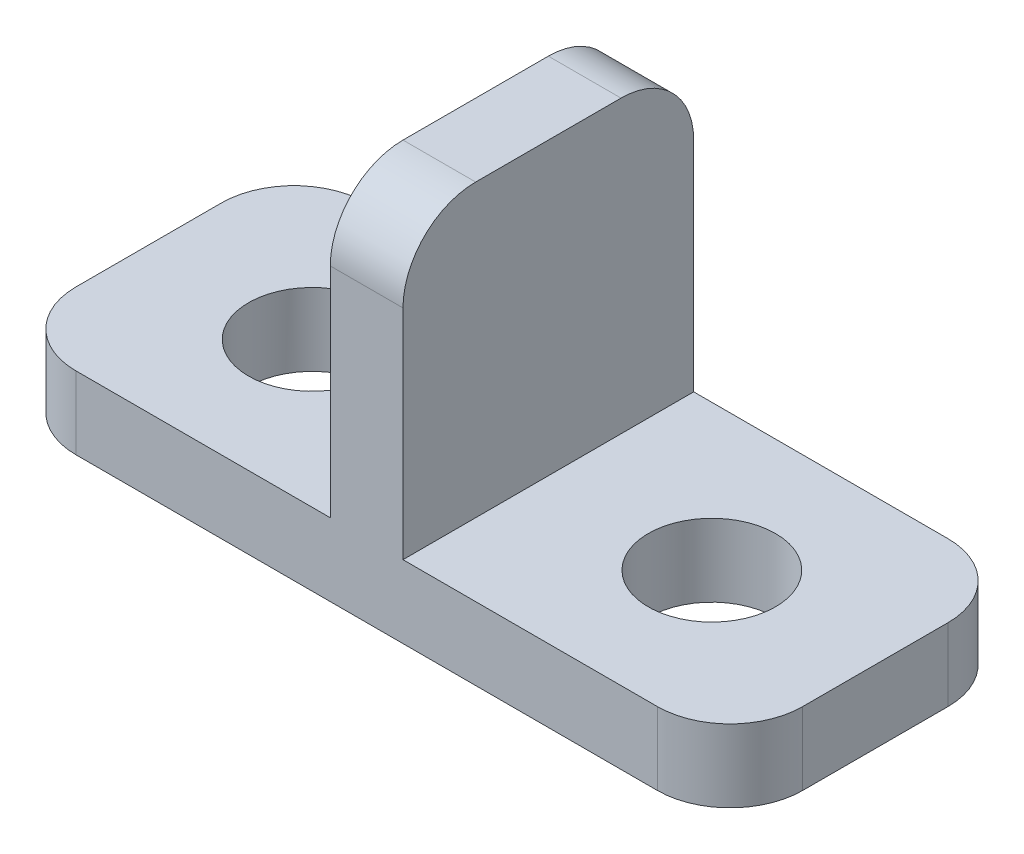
ISO-10303-21;
HEADER;
FILE_DESCRIPTION(('STEP AP214'),'2;1');
FILE_NAME('part.step','',(''),(''),'','','');
FILE_SCHEMA(('AUTOMOTIVE_DESIGN { 1 0 10303 214 1 1 1 1 }'));
ENDSEC;
DATA;
#1=APPLICATION_CONTEXT('core data for automotive mechanical design processes');
#2=APPLICATION_PROTOCOL_DEFINITION('international standard','automotive_design',2000,#1);
#3=PRODUCT_CONTEXT('',#1,'mechanical');
#4=PRODUCT('Part','Part','',(#3));
#5=PRODUCT_RELATED_PRODUCT_CATEGORY('part','',(#4));
#6=PRODUCT_DEFINITION_FORMATION('','',#4);
#7=PRODUCT_DEFINITION_CONTEXT('part definition',#1,'design');
#8=PRODUCT_DEFINITION('design','',#6,#7);
#9=PRODUCT_DEFINITION_SHAPE('','',#8);
#10=(LENGTH_UNIT() NAMED_UNIT(*) SI_UNIT(.MILLI.,.METRE.));
#11=(NAMED_UNIT(*) PLANE_ANGLE_UNIT() SI_UNIT($,.RADIAN.));
#12=(NAMED_UNIT(*) SI_UNIT($,.STERADIAN.) SOLID_ANGLE_UNIT());
#13=UNCERTAINTY_MEASURE_WITH_UNIT(LENGTH_MEASURE(1.E-05),#10,'distance_accuracy_value','');
#14=(GEOMETRIC_REPRESENTATION_CONTEXT(3) GLOBAL_UNCERTAINTY_ASSIGNED_CONTEXT((#13)) GLOBAL_UNIT_ASSIGNED_CONTEXT((#10,
#11,#12)) REPRESENTATION_CONTEXT('',''));
#15=CARTESIAN_POINT('',(0.,0.,0.));
#16=DIRECTION('',(0.,0.,1.));
#17=DIRECTION('',(1.,0.,0.));
#18=AXIS2_PLACEMENT_3D('',#15,#16,#17);
#19=CARTESIAN_POINT('',(0.,2.,0.));
#20=DIRECTION('',(0.,-1.,0.));
#21=DIRECTION('',(0.,0.,-1.));
#22=AXIS2_PLACEMENT_3D('',#19,#20,#21);
#23=PLANE('',#22);
#24=CARTESIAN_POINT('',(5.5,2.,0.));
#25=DIRECTION('',(0.,1.,0.));
#26=DIRECTION('',(0.,0.,-1.));
#27=AXIS2_PLACEMENT_3D('',#24,#25,#26);
#28=CIRCLE('',#27,1.75);
#29=CARTESIAN_POINT('',(5.5,2.,-1.75));
#30=VERTEX_POINT('',#29);
#31=EDGE_CURVE('E293',#30,#30,#28,.T.);
#32=ORIENTED_EDGE('',*,*,#31,.F.);
#33=EDGE_LOOP('',(#32));
#34=FACE_BOUND('',#33,.T.);
#35=DIRECTION('',(0.,0.,-1.));
#36=VECTOR('',#35,1.);
#37=CARTESIAN_POINT('',(10.,2.,4.));
#38=LINE('',#37,#36);
#39=CARTESIAN_POINT('',(10.,2.,2.));
#40=VERTEX_POINT('',#39);
#41=CARTESIAN_POINT('',(10.,2.,-2.));
#42=VERTEX_POINT('',#41);
#43=EDGE_CURVE('E179',#40,#42,#38,.T.);
#44=ORIENTED_EDGE('',*,*,#43,.T.);
#45=CARTESIAN_POINT('',(8.,2.,-2.));
#46=DIRECTION('',(0.,-1.,0.));
#47=DIRECTION('',(0.,0.,-1.));
#48=AXIS2_PLACEMENT_3D('',#45,#46,#47);
#49=CIRCLE('',#48,2.);
#50=CARTESIAN_POINT('',(8.,2.,-4.));
#51=VERTEX_POINT('',#50);
#52=EDGE_CURVE('E243',#42,#51,#49,.F.);
#53=ORIENTED_EDGE('',*,*,#52,.T.);
#54=DIRECTION('',(-1.,0.,0.));
#55=VECTOR('',#54,1.);
#56=CARTESIAN_POINT('',(-10.,2.,-4.));
#57=LINE('',#56,#55);
#58=CARTESIAN_POINT('',(1.,2.,-4.));
#59=VERTEX_POINT('',#58);
#60=EDGE_CURVE('E184',#51,#59,#57,.T.);
#61=ORIENTED_EDGE('',*,*,#60,.T.);
#62=DIRECTION('',(0.,0.,-1.));
#63=VECTOR('',#62,1.);
#64=CARTESIAN_POINT('',(1.,2.,4.));
#65=LINE('',#64,#63);
#66=CARTESIAN_POINT('',(1.,2.,4.));
#67=VERTEX_POINT('',#66);
#68=EDGE_CURVE('E163',#67,#59,#65,.T.);
#69=ORIENTED_EDGE('',*,*,#68,.F.);
#70=DIRECTION('',(1.,0.,0.));
#71=VECTOR('',#70,1.);
#72=CARTESIAN_POINT('',(-10.,2.,4.));
#73=LINE('',#72,#71);
#74=CARTESIAN_POINT('',(8.,2.,4.));
#75=VERTEX_POINT('',#74);
#76=EDGE_CURVE('E146',#67,#75,#73,.T.);
#77=ORIENTED_EDGE('',*,*,#76,.T.);
#78=CARTESIAN_POINT('',(8.,2.,2.));
#79=DIRECTION('',(0.,-1.,0.));
#80=DIRECTION('',(0.,0.,-1.));
#81=AXIS2_PLACEMENT_3D('',#78,#79,#80);
#82=CIRCLE('',#81,2.);
#83=EDGE_CURVE('E241',#75,#40,#82,.F.);
#84=ORIENTED_EDGE('',*,*,#83,.T.);
#85=EDGE_LOOP('',(#44,#53,#61,#69,#77,#84));
#86=FACE_BOUND('',#85,.T.);
#87=ADVANCED_FACE('F35',(#34,#86),#23,.F.);
#88=CARTESIAN_POINT('',(-5.5,2.,0.));
#89=DIRECTION('',(0.,1.,0.));
#90=DIRECTION('',(0.,0.,1.));
#91=AXIS2_PLACEMENT_3D('',#88,#89,#90);
#92=CIRCLE('',#91,1.75);
#93=CARTESIAN_POINT('',(-5.5,2.,1.75));
#94=VERTEX_POINT('',#93);
#95=EDGE_CURVE('E200',#94,#94,#92,.T.);
#96=ORIENTED_EDGE('',*,*,#95,.F.);
#97=EDGE_LOOP('',(#96));
#98=FACE_BOUND('',#97,.T.);
#99=DIRECTION('',(0.,0.,1.));
#100=VECTOR('',#99,1.);
#101=CARTESIAN_POINT('',(-10.,2.,4.));
#102=LINE('',#101,#100);
#103=CARTESIAN_POINT('',(-10.,2.,-2.));
#104=VERTEX_POINT('',#103);
#105=CARTESIAN_POINT('',(-10.,2.,2.));
#106=VERTEX_POINT('',#105);
#107=EDGE_CURVE('E186',#104,#106,#102,.T.);
#108=ORIENTED_EDGE('',*,*,#107,.T.);
#109=CARTESIAN_POINT('',(-8.,2.,2.));
#110=DIRECTION('',(0.,-1.,0.));
#111=DIRECTION('',(0.,0.,-1.));
#112=AXIS2_PLACEMENT_3D('',#109,#110,#111);
#113=CIRCLE('',#112,2.);
#114=CARTESIAN_POINT('',(-8.,2.,4.));
#115=VERTEX_POINT('',#114);
#116=EDGE_CURVE('E11',#106,#115,#113,.F.);
#117=ORIENTED_EDGE('',*,*,#116,.T.);
#118=CARTESIAN_POINT('',(-1.,2.,4.));
#119=VERTEX_POINT('',#118);
#120=EDGE_CURVE('E135',#115,#119,#73,.T.);
#121=ORIENTED_EDGE('',*,*,#120,.T.);
#122=DIRECTION('',(0.,0.,1.));
#123=VECTOR('',#122,1.);
#124=CARTESIAN_POINT('',(-1.,2.,4.));
#125=LINE('',#124,#123);
#126=CARTESIAN_POINT('',(-0.999999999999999,2.,-4.));
#127=VERTEX_POINT('',#126);
#128=EDGE_CURVE('E139',#127,#119,#125,.T.);
#129=ORIENTED_EDGE('',*,*,#128,.F.);
#130=CARTESIAN_POINT('',(-8.,2.,-4.));
#131=VERTEX_POINT('',#130);
#132=EDGE_CURVE('E182',#127,#131,#57,.T.);
#133=ORIENTED_EDGE('',*,*,#132,.T.);
#134=CARTESIAN_POINT('',(-8.,2.,-2.));
#135=DIRECTION('',(0.,-1.,0.));
#136=DIRECTION('',(0.,0.,-1.));
#137=AXIS2_PLACEMENT_3D('',#134,#135,#136);
#138=CIRCLE('',#137,2.);
#139=EDGE_CURVE('E43',#131,#104,#138,.F.);
#140=ORIENTED_EDGE('',*,*,#139,.T.);
#141=EDGE_LOOP('',(#108,#117,#121,#129,#133,#140));
#142=FACE_BOUND('',#141,.T.);
#143=ADVANCED_FACE('F137',(#98,#142),#23,.F.);
#144=CARTESIAN_POINT('',(10.,2.,4.));
#145=DIRECTION('',(-1.,0.,0.));
#146=DIRECTION('',(0.,0.,1.));
#147=AXIS2_PLACEMENT_3D('',#144,#145,#146);
#148=PLANE('',#147);
#149=DIRECTION('',(0.,0.,-1.));
#150=VECTOR('',#149,1.);
#151=CARTESIAN_POINT('',(10.,0.,4.));
#152=LINE('',#151,#150);
#153=CARTESIAN_POINT('',(10.,0.,2.));
#154=VERTEX_POINT('',#153);
#155=CARTESIAN_POINT('',(10.,0.,-2.));
#156=VERTEX_POINT('',#155);
#157=EDGE_CURVE('E178',#154,#156,#152,.T.);
#158=ORIENTED_EDGE('',*,*,#157,.T.);
#159=DIRECTION('',(0.,-1.,0.));
#160=VECTOR('',#159,1.);
#161=CARTESIAN_POINT('',(10.,2.,-2.));
#162=LINE('',#161,#160);
#163=EDGE_CURVE('E239',#156,#42,#162,.F.);
#164=ORIENTED_EDGE('',*,*,#163,.T.);
#165=ORIENTED_EDGE('',*,*,#43,.F.);
#166=DIRECTION('',(0.,-1.,0.));
#167=VECTOR('',#166,1.);
#168=CARTESIAN_POINT('',(10.,2.,2.));
#169=LINE('',#168,#167);
#170=EDGE_CURVE('E236',#40,#154,#169,.T.);
#171=ORIENTED_EDGE('',*,*,#170,.T.);
#172=EDGE_LOOP('',(#158,#164,#165,#171));
#173=FACE_BOUND('',#172,.T.);
#174=ADVANCED_FACE('F270',(#173),#148,.F.);
#175=CARTESIAN_POINT('',(-10.,2.,-4.));
#176=DIRECTION('',(0.,0.,1.));
#177=DIRECTION('',(1.,0.,0.));
#178=AXIS2_PLACEMENT_3D('',#175,#176,#177);
#179=PLANE('',#178);
#180=DIRECTION('',(0.,-1.,0.));
#181=VECTOR('',#180,1.);
#182=CARTESIAN_POINT('',(-1.,10.,-4.));
#183=LINE('',#182,#181);
#184=CARTESIAN_POINT('',(-1.,8.,-4.));
#185=VERTEX_POINT('',#184);
#186=EDGE_CURVE('E156',#185,#127,#183,.T.);
#187=ORIENTED_EDGE('',*,*,#186,.F.);
#188=DIRECTION('',(-1.,0.,0.));
#189=VECTOR('',#188,1.);
#190=CARTESIAN_POINT('',(-10.,8.,-4.));
#191=LINE('',#190,#189);
#192=CARTESIAN_POINT('',(1.,8.,-4.));
#193=VERTEX_POINT('',#192);
#194=EDGE_CURVE('E217',#185,#193,#191,.F.);
#195=ORIENTED_EDGE('',*,*,#194,.T.);
#196=DIRECTION('',(0.,-1.,0.));
#197=VECTOR('',#196,1.);
#198=CARTESIAN_POINT('',(1.,10.,-4.));
#199=LINE('',#198,#197);
#200=EDGE_CURVE('E175',#193,#59,#199,.T.);
#201=ORIENTED_EDGE('',*,*,#200,.T.);
#202=ORIENTED_EDGE('',*,*,#60,.F.);
#203=DIRECTION('',(0.,-1.,0.));
#204=VECTOR('',#203,1.);
#205=CARTESIAN_POINT('',(8.,2.,-4.));
#206=LINE('',#205,#204);
#207=CARTESIAN_POINT('',(8.,0.,-4.));
#208=VERTEX_POINT('',#207);
#209=EDGE_CURVE('E214',#51,#208,#206,.T.);
#210=ORIENTED_EDGE('',*,*,#209,.T.);
#211=DIRECTION('',(-1.,0.,0.));
#212=VECTOR('',#211,1.);
#213=CARTESIAN_POINT('',(-10.,0.,-4.));
#214=LINE('',#213,#212);
#215=CARTESIAN_POINT('',(-8.,0.,-4.));
#216=VERTEX_POINT('',#215);
#217=EDGE_CURVE('E190',#208,#216,#214,.T.);
#218=ORIENTED_EDGE('',*,*,#217,.T.);
#219=DIRECTION('',(0.,-1.,0.));
#220=VECTOR('',#219,1.);
#221=CARTESIAN_POINT('',(-8.,2.,-4.));
#222=LINE('',#221,#220);
#223=EDGE_CURVE('E212',#216,#131,#222,.F.);
#224=ORIENTED_EDGE('',*,*,#223,.T.);
#225=ORIENTED_EDGE('',*,*,#132,.F.);
#226=EDGE_LOOP('',(#187,#195,#201,#202,#210,#218,#224,#225));
#227=FACE_BOUND('',#226,.T.);
#228=ADVANCED_FACE('F278',(#227),#179,.F.);
#229=CARTESIAN_POINT('',(-10.,2.,4.));
#230=DIRECTION('',(1.,0.,0.));
#231=DIRECTION('',(0.,0.,-1.));
#232=AXIS2_PLACEMENT_3D('',#229,#230,#231);
#233=PLANE('',#232);
#234=DIRECTION('',(0.,0.,1.));
#235=VECTOR('',#234,1.);
#236=CARTESIAN_POINT('',(-10.,0.,4.));
#237=LINE('',#236,#235);
#238=CARTESIAN_POINT('',(-10.,0.,-2.));
#239=VERTEX_POINT('',#238);
#240=CARTESIAN_POINT('',(-10.,0.,2.));
#241=VERTEX_POINT('',#240);
#242=EDGE_CURVE('E193',#239,#241,#237,.T.);
#243=ORIENTED_EDGE('',*,*,#242,.T.);
#244=DIRECTION('',(0.,-1.,0.));
#245=VECTOR('',#244,1.);
#246=CARTESIAN_POINT('',(-10.,2.,2.));
#247=LINE('',#246,#245);
#248=EDGE_CURVE('E50',#241,#106,#247,.F.);
#249=ORIENTED_EDGE('',*,*,#248,.T.);
#250=ORIENTED_EDGE('',*,*,#107,.F.);
#251=DIRECTION('',(0.,-1.,0.));
#252=VECTOR('',#251,1.);
#253=CARTESIAN_POINT('',(-10.,2.,-2.));
#254=LINE('',#253,#252);
#255=EDGE_CURVE('E245',#104,#239,#254,.T.);
#256=ORIENTED_EDGE('',*,*,#255,.T.);
#257=EDGE_LOOP('',(#243,#249,#250,#256));
#258=FACE_BOUND('',#257,.T.);
#259=ADVANCED_FACE('F250',(#258),#233,.F.);
#260=CARTESIAN_POINT('',(-10.,2.,4.));
#261=DIRECTION('',(0.,0.,-1.));
#262=DIRECTION('',(-1.,0.,0.));
#263=AXIS2_PLACEMENT_3D('',#260,#261,#262);
#264=PLANE('',#263);
#265=DIRECTION('',(0.,-1.,0.));
#266=VECTOR('',#265,1.);
#267=CARTESIAN_POINT('',(1.,10.,4.));
#268=LINE('',#267,#266);
#269=CARTESIAN_POINT('',(1.,8.,4.));
#270=VERTEX_POINT('',#269);
#271=EDGE_CURVE('E157',#270,#67,#268,.T.);
#272=ORIENTED_EDGE('',*,*,#271,.F.);
#273=DIRECTION('',(1.,0.,0.));
#274=VECTOR('',#273,1.);
#275=CARTESIAN_POINT('',(-10.,8.,4.));
#276=LINE('',#275,#274);
#277=CARTESIAN_POINT('',(-1.,8.,4.));
#278=VERTEX_POINT('',#277);
#279=EDGE_CURVE('E153',#270,#278,#276,.F.);
#280=ORIENTED_EDGE('',*,*,#279,.T.);
#281=DIRECTION('',(0.,-1.,0.));
#282=VECTOR('',#281,1.);
#283=CARTESIAN_POINT('',(-1.,10.,4.));
#284=LINE('',#283,#282);
#285=EDGE_CURVE('E149',#278,#119,#284,.T.);
#286=ORIENTED_EDGE('',*,*,#285,.T.);
#287=ORIENTED_EDGE('',*,*,#120,.F.);
#288=DIRECTION('',(0.,-1.,0.));
#289=VECTOR('',#288,1.);
#290=CARTESIAN_POINT('',(-8.,2.,4.));
#291=LINE('',#290,#289);
#292=CARTESIAN_POINT('',(-8.,0.,4.));
#293=VERTEX_POINT('',#292);
#294=EDGE_CURVE('E223',#115,#293,#291,.T.);
#295=ORIENTED_EDGE('',*,*,#294,.T.);
#296=DIRECTION('',(1.,0.,0.));
#297=VECTOR('',#296,1.);
#298=CARTESIAN_POINT('',(-10.,0.,4.));
#299=LINE('',#298,#297);
#300=CARTESIAN_POINT('',(8.,0.,4.));
#301=VERTEX_POINT('',#300);
#302=EDGE_CURVE('E183',#293,#301,#299,.T.);
#303=ORIENTED_EDGE('',*,*,#302,.T.);
#304=DIRECTION('',(0.,-1.,0.));
#305=VECTOR('',#304,1.);
#306=CARTESIAN_POINT('',(8.,2.,4.));
#307=LINE('',#306,#305);
#308=EDGE_CURVE('E225',#301,#75,#307,.F.);
#309=ORIENTED_EDGE('',*,*,#308,.T.);
#310=ORIENTED_EDGE('',*,*,#76,.F.);
#311=EDGE_LOOP('',(#272,#280,#286,#287,#295,#303,#309,#310));
#312=FACE_BOUND('',#311,.T.);
#313=ADVANCED_FACE('F151',(#312),#264,.F.);
#314=CARTESIAN_POINT('',(0.,0.,0.));
#315=DIRECTION('',(0.,-1.,0.));
#316=DIRECTION('',(0.,0.,-1.));
#317=AXIS2_PLACEMENT_3D('',#314,#315,#316);
#318=PLANE('',#317);
#319=CARTESIAN_POINT('',(-5.5,0.,0.));
#320=DIRECTION('',(0.,-1.,0.));
#321=DIRECTION('',(0.,0.,-1.));
#322=AXIS2_PLACEMENT_3D('',#319,#320,#321);
#323=CIRCLE('',#322,1.75);
#324=CARTESIAN_POINT('',(-5.5,0.,-1.75));
#325=VERTEX_POINT('',#324);
#326=EDGE_CURVE('E169',#325,#325,#323,.T.);
#327=ORIENTED_EDGE('',*,*,#326,.F.);
#328=EDGE_LOOP('',(#327));
#329=FACE_BOUND('',#328,.T.);
#330=CARTESIAN_POINT('',(5.5,0.,0.));
#331=DIRECTION('',(0.,-1.,0.));
#332=DIRECTION('',(0.,0.,-1.));
#333=AXIS2_PLACEMENT_3D('',#330,#331,#332);
#334=CIRCLE('',#333,1.75);
#335=CARTESIAN_POINT('',(5.5,0.,-1.75));
#336=VERTEX_POINT('',#335);
#337=EDGE_CURVE('E197',#336,#336,#334,.T.);
#338=ORIENTED_EDGE('',*,*,#337,.F.);
#339=EDGE_LOOP('',(#338));
#340=FACE_BOUND('',#339,.T.);
#341=ORIENTED_EDGE('',*,*,#217,.F.);
#342=CARTESIAN_POINT('',(8.,0.,-2.));
#343=DIRECTION('',(0.,-1.,0.));
#344=DIRECTION('',(0.,0.,-1.));
#345=AXIS2_PLACEMENT_3D('',#342,#343,#344);
#346=CIRCLE('',#345,2.);
#347=EDGE_CURVE('E234',#208,#156,#346,.T.);
#348=ORIENTED_EDGE('',*,*,#347,.T.);
#349=ORIENTED_EDGE('',*,*,#157,.F.);
#350=CARTESIAN_POINT('',(8.,0.,2.));
#351=DIRECTION('',(0.,-1.,0.));
#352=DIRECTION('',(0.,0.,-1.));
#353=AXIS2_PLACEMENT_3D('',#350,#351,#352);
#354=CIRCLE('',#353,2.);
#355=EDGE_CURVE('E232',#154,#301,#354,.T.);
#356=ORIENTED_EDGE('',*,*,#355,.T.);
#357=ORIENTED_EDGE('',*,*,#302,.F.);
#358=CARTESIAN_POINT('',(-8.,0.,2.));
#359=DIRECTION('',(0.,-1.,0.));
#360=DIRECTION('',(0.,0.,-1.));
#361=AXIS2_PLACEMENT_3D('',#358,#359,#360);
#362=CIRCLE('',#361,2.);
#363=EDGE_CURVE('E230',#293,#241,#362,.T.);
#364=ORIENTED_EDGE('',*,*,#363,.T.);
#365=ORIENTED_EDGE('',*,*,#242,.F.);
#366=CARTESIAN_POINT('',(-8.,0.,-2.));
#367=DIRECTION('',(0.,-1.,0.));
#368=DIRECTION('',(0.,0.,-1.));
#369=AXIS2_PLACEMENT_3D('',#366,#367,#368);
#370=CIRCLE('',#369,2.);
#371=EDGE_CURVE('E228',#239,#216,#370,.T.);
#372=ORIENTED_EDGE('',*,*,#371,.T.);
#373=EDGE_LOOP('',(#341,#348,#349,#356,#357,#364,#365,#372));
#374=FACE_BOUND('',#373,.T.);
#375=ADVANCED_FACE('F254',(#329,#340,#374),#318,.T.);
#376=CARTESIAN_POINT('',(1.,10.,4.));
#377=DIRECTION('',(-1.,0.,0.));
#378=DIRECTION('',(0.,0.,1.));
#379=AXIS2_PLACEMENT_3D('',#376,#377,#378);
#380=PLANE('',#379);
#381=ORIENTED_EDGE('',*,*,#200,.F.);
#382=CARTESIAN_POINT('',(1.,8.,-2.));
#383=DIRECTION('',(-1.,0.,0.));
#384=DIRECTION('',(0.,0.,1.));
#385=AXIS2_PLACEMENT_3D('',#382,#383,#384);
#386=CIRCLE('',#385,2.);
#387=CARTESIAN_POINT('',(1.,10.,-2.));
#388=VERTEX_POINT('',#387);
#389=EDGE_CURVE('E221',#193,#388,#386,.F.);
#390=ORIENTED_EDGE('',*,*,#389,.T.);
#391=DIRECTION('',(0.,0.,-1.));
#392=VECTOR('',#391,1.);
#393=CARTESIAN_POINT('',(1.,10.,4.));
#394=LINE('',#393,#392);
#395=CARTESIAN_POINT('',(1.,10.,2.));
#396=VERTEX_POINT('',#395);
#397=EDGE_CURVE('E162',#396,#388,#394,.T.);
#398=ORIENTED_EDGE('',*,*,#397,.F.);
#399=CARTESIAN_POINT('',(1.,8.,2.));
#400=DIRECTION('',(-1.,0.,0.));
#401=DIRECTION('',(0.,0.,1.));
#402=AXIS2_PLACEMENT_3D('',#399,#400,#401);
#403=CIRCLE('',#402,2.);
#404=EDGE_CURVE('E219',#396,#270,#403,.F.);
#405=ORIENTED_EDGE('',*,*,#404,.T.);
#406=ORIENTED_EDGE('',*,*,#271,.T.);
#407=ORIENTED_EDGE('',*,*,#68,.T.);
#408=EDGE_LOOP('',(#381,#390,#398,#405,#406,#407));
#409=FACE_BOUND('',#408,.T.);
#410=ADVANCED_FACE('F283',(#409),#380,.F.);
#411=CARTESIAN_POINT('',(-1.,10.,4.));
#412=DIRECTION('',(1.,0.,0.));
#413=DIRECTION('',(0.,0.,-1.));
#414=AXIS2_PLACEMENT_3D('',#411,#412,#413);
#415=PLANE('',#414);
#416=DIRECTION('',(0.,0.,1.));
#417=VECTOR('',#416,1.);
#418=CARTESIAN_POINT('',(-1.,10.,4.));
#419=LINE('',#418,#417);
#420=CARTESIAN_POINT('',(-1.,10.,-2.));
#421=VERTEX_POINT('',#420);
#422=CARTESIAN_POINT('',(-1.,10.,2.));
#423=VERTEX_POINT('',#422);
#424=EDGE_CURVE('E166',#421,#423,#419,.T.);
#425=ORIENTED_EDGE('',*,*,#424,.F.);
#426=CARTESIAN_POINT('',(-1.,8.,-2.));
#427=DIRECTION('',(1.,0.,0.));
#428=DIRECTION('',(0.,0.,-1.));
#429=AXIS2_PLACEMENT_3D('',#426,#427,#428);
#430=CIRCLE('',#429,2.);
#431=EDGE_CURVE('E210',#421,#185,#430,.F.);
#432=ORIENTED_EDGE('',*,*,#431,.T.);
#433=ORIENTED_EDGE('',*,*,#186,.T.);
#434=ORIENTED_EDGE('',*,*,#128,.T.);
#435=ORIENTED_EDGE('',*,*,#285,.F.);
#436=CARTESIAN_POINT('',(-1.,8.,2.));
#437=DIRECTION('',(1.,0.,0.));
#438=DIRECTION('',(0.,0.,-1.));
#439=AXIS2_PLACEMENT_3D('',#436,#437,#438);
#440=CIRCLE('',#439,2.);
#441=EDGE_CURVE('E208',#278,#423,#440,.F.);
#442=ORIENTED_EDGE('',*,*,#441,.T.);
#443=EDGE_LOOP('',(#425,#432,#433,#434,#435,#442));
#444=FACE_BOUND('',#443,.T.);
#445=ADVANCED_FACE('F160',(#444),#415,.F.);
#446=CARTESIAN_POINT('',(0.,10.,0.));
#447=DIRECTION('',(0.,-1.,0.));
#448=DIRECTION('',(0.,0.,-1.));
#449=AXIS2_PLACEMENT_3D('',#446,#447,#448);
#450=PLANE('',#449);
#451=ORIENTED_EDGE('',*,*,#397,.T.);
#452=DIRECTION('',(-1.,0.,0.));
#453=VECTOR('',#452,1.);
#454=CARTESIAN_POINT('',(0.,10.,-2.));
#455=LINE('',#454,#453);
#456=EDGE_CURVE('E205',#388,#421,#455,.T.);
#457=ORIENTED_EDGE('',*,*,#456,.T.);
#458=ORIENTED_EDGE('',*,*,#424,.T.);
#459=DIRECTION('',(1.,0.,0.));
#460=VECTOR('',#459,1.);
#461=CARTESIAN_POINT('',(0.,10.,2.));
#462=LINE('',#461,#460);
#463=EDGE_CURVE('E145',#423,#396,#462,.T.);
#464=ORIENTED_EDGE('',*,*,#463,.T.);
#465=EDGE_LOOP('',(#451,#457,#458,#464));
#466=FACE_BOUND('',#465,.T.);
#467=ADVANCED_FACE('F289',(#466),#450,.F.);
#468=CARTESIAN_POINT('',(5.5,-8.,0.));
#469=DIRECTION('',(0.,1.,0.));
#470=DIRECTION('',(0.,0.,1.));
#471=AXIS2_PLACEMENT_3D('',#468,#469,#470);
#472=CYLINDRICAL_SURFACE('',#471,1.75);
#473=ORIENTED_EDGE('',*,*,#337,.T.);
#474=EDGE_LOOP('',(#473));
#475=FACE_BOUND('',#474,.T.);
#476=ORIENTED_EDGE('',*,*,#31,.T.);
#477=EDGE_LOOP('',(#476));
#478=FACE_BOUND('',#477,.T.);
#479=ADVANCED_FACE('F376',(#475,#478),#472,.F.);
#480=CARTESIAN_POINT('',(-5.5,-8.,0.));
#481=DIRECTION('',(0.,1.,0.));
#482=DIRECTION('',(0.,0.,1.));
#483=AXIS2_PLACEMENT_3D('',#480,#481,#482);
#484=CYLINDRICAL_SURFACE('',#483,1.75);
#485=ORIENTED_EDGE('',*,*,#326,.T.);
#486=EDGE_LOOP('',(#485));
#487=FACE_BOUND('',#486,.T.);
#488=ORIENTED_EDGE('',*,*,#95,.T.);
#489=EDGE_LOOP('',(#488));
#490=FACE_BOUND('',#489,.T.);
#491=ADVANCED_FACE('F299',(#487,#490),#484,.F.);
#492=CARTESIAN_POINT('',(0.,8.,-2.));
#493=DIRECTION('',(-1.,0.,0.));
#494=DIRECTION('',(0.,0.,1.));
#495=AXIS2_PLACEMENT_3D('',#492,#493,#494);
#496=CYLINDRICAL_SURFACE('',#495,2.);
#497=ORIENTED_EDGE('',*,*,#389,.F.);
#498=ORIENTED_EDGE('',*,*,#194,.F.);
#499=ORIENTED_EDGE('',*,*,#431,.F.);
#500=ORIENTED_EDGE('',*,*,#456,.F.);
#501=EDGE_LOOP('',(#497,#498,#499,#500));
#502=FACE_BOUND('',#501,.T.);
#503=ADVANCED_FACE('F321',(#502),#496,.T.);
#504=CARTESIAN_POINT('',(0.,8.,2.));
#505=DIRECTION('',(1.,0.,0.));
#506=DIRECTION('',(0.,0.,-1.));
#507=AXIS2_PLACEMENT_3D('',#504,#505,#506);
#508=CYLINDRICAL_SURFACE('',#507,2.);
#509=ORIENTED_EDGE('',*,*,#441,.F.);
#510=ORIENTED_EDGE('',*,*,#279,.F.);
#511=ORIENTED_EDGE('',*,*,#404,.F.);
#512=ORIENTED_EDGE('',*,*,#463,.F.);
#513=EDGE_LOOP('',(#509,#510,#511,#512));
#514=FACE_BOUND('',#513,.T.);
#515=ADVANCED_FACE('F285',(#514),#508,.T.);
#516=CARTESIAN_POINT('',(8.,2.,-2.));
#517=DIRECTION('',(0.,-1.,0.));
#518=DIRECTION('',(0.,0.,-1.));
#519=AXIS2_PLACEMENT_3D('',#516,#517,#518);
#520=CYLINDRICAL_SURFACE('',#519,2.);
#521=ORIENTED_EDGE('',*,*,#52,.F.);
#522=ORIENTED_EDGE('',*,*,#163,.F.);
#523=ORIENTED_EDGE('',*,*,#347,.F.);
#524=ORIENTED_EDGE('',*,*,#209,.F.);
#525=EDGE_LOOP('',(#521,#522,#523,#524));
#526=FACE_BOUND('',#525,.T.);
#527=ADVANCED_FACE('F274',(#526),#520,.T.);
#528=CARTESIAN_POINT('',(8.,2.,2.));
#529=DIRECTION('',(0.,-1.,0.));
#530=DIRECTION('',(0.,0.,-1.));
#531=AXIS2_PLACEMENT_3D('',#528,#529,#530);
#532=CYLINDRICAL_SURFACE('',#531,2.);
#533=ORIENTED_EDGE('',*,*,#83,.F.);
#534=ORIENTED_EDGE('',*,*,#308,.F.);
#535=ORIENTED_EDGE('',*,*,#355,.F.);
#536=ORIENTED_EDGE('',*,*,#170,.F.);
#537=EDGE_LOOP('',(#533,#534,#535,#536));
#538=FACE_BOUND('',#537,.T.);
#539=ADVANCED_FACE('F263',(#538),#532,.T.);
#540=CARTESIAN_POINT('',(-8.,2.,2.));
#541=DIRECTION('',(0.,-1.,0.));
#542=DIRECTION('',(0.,0.,-1.));
#543=AXIS2_PLACEMENT_3D('',#540,#541,#542);
#544=CYLINDRICAL_SURFACE('',#543,2.);
#545=ORIENTED_EDGE('',*,*,#116,.F.);
#546=ORIENTED_EDGE('',*,*,#248,.F.);
#547=ORIENTED_EDGE('',*,*,#363,.F.);
#548=ORIENTED_EDGE('',*,*,#294,.F.);
#549=EDGE_LOOP('',(#545,#546,#547,#548));
#550=FACE_BOUND('',#549,.T.);
#551=ADVANCED_FACE('F257',(#550),#544,.T.);
#552=CARTESIAN_POINT('',(-8.,2.,-2.));
#553=DIRECTION('',(0.,-1.,0.));
#554=DIRECTION('',(0.,0.,-1.));
#555=AXIS2_PLACEMENT_3D('',#552,#553,#554);
#556=CYLINDRICAL_SURFACE('',#555,2.);
#557=ORIENTED_EDGE('',*,*,#139,.F.);
#558=ORIENTED_EDGE('',*,*,#223,.F.);
#559=ORIENTED_EDGE('',*,*,#371,.F.);
#560=ORIENTED_EDGE('',*,*,#255,.F.);
#561=EDGE_LOOP('',(#557,#558,#559,#560));
#562=FACE_BOUND('',#561,.T.);
#563=ADVANCED_FACE('F37',(#562),#556,.T.);
#564=CLOSED_SHELL('',(#87,#143,#174,#228,#259,#313,#375,#410,#445,#467,#479,#491,#503,#515,#527,
#539,#551,#563));
#565=MANIFOLD_SOLID_BREP('B2',#564);
#566=ADVANCED_BREP_SHAPE_REPRESENTATION('',(#18,#565),#14);
#567=SHAPE_DEFINITION_REPRESENTATION(#9,#566);
ENDSEC;
END-ISO-10303-21;
